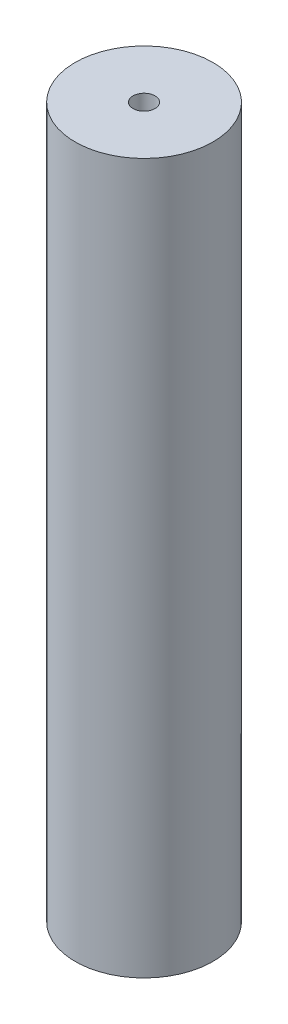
ISO-10303-21;
HEADER;
FILE_DESCRIPTION(('STEP AP214'),'2;1');
FILE_NAME('part.step','',(''),(''),'','','');
FILE_SCHEMA(('AUTOMOTIVE_DESIGN { 1 0 10303 214 1 1 1 1 }'));
ENDSEC;
DATA;
#1=APPLICATION_CONTEXT('core data for automotive mechanical design processes');
#2=APPLICATION_PROTOCOL_DEFINITION('international standard','automotive_design',2000,#1);
#3=PRODUCT_CONTEXT('',#1,'mechanical');
#4=PRODUCT('Part','Part','',(#3));
#5=PRODUCT_RELATED_PRODUCT_CATEGORY('part','',(#4));
#6=PRODUCT_DEFINITION_FORMATION('','',#4);
#7=PRODUCT_DEFINITION_CONTEXT('part definition',#1,'design');
#8=PRODUCT_DEFINITION('design','',#6,#7);
#9=PRODUCT_DEFINITION_SHAPE('','',#8);
#10=(LENGTH_UNIT() NAMED_UNIT(*) SI_UNIT(.MILLI.,.METRE.));
#11=(NAMED_UNIT(*) PLANE_ANGLE_UNIT() SI_UNIT($,.RADIAN.));
#12=(NAMED_UNIT(*) SI_UNIT($,.STERADIAN.) SOLID_ANGLE_UNIT());
#13=UNCERTAINTY_MEASURE_WITH_UNIT(LENGTH_MEASURE(1.E-05),#10,'distance_accuracy_value','');
#14=(GEOMETRIC_REPRESENTATION_CONTEXT(3) GLOBAL_UNCERTAINTY_ASSIGNED_CONTEXT((#13)) GLOBAL_UNIT_ASSIGNED_CONTEXT((#10,
#11,#12)) REPRESENTATION_CONTEXT('',''));
#15=CARTESIAN_POINT('',(0.,0.,0.));
#16=DIRECTION('',(0.,0.,1.));
#17=DIRECTION('',(1.,0.,0.));
#18=AXIS2_PLACEMENT_3D('',#15,#16,#17);
#19=CARTESIAN_POINT('',(15.,-19.2842712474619,130.));
#20=DIRECTION('',(0.,1.,0.));
#21=DIRECTION('',(0.,0.,1.));
#22=AXIS2_PLACEMENT_3D('',#19,#20,#21);
#23=CYLINDRICAL_SURFACE('',#22,10.);
#24=CARTESIAN_POINT('',(15.,110.,130.));
#25=DIRECTION('',(0.,-1.,0.));
#26=DIRECTION('',(0.,0.,-1.));
#27=AXIS2_PLACEMENT_3D('',#24,#25,#26);
#28=CIRCLE('',#27,10.);
#29=CARTESIAN_POINT('',(15.,110.,120.));
#30=VERTEX_POINT('',#29);
#31=EDGE_CURVE('E45',#30,#30,#28,.T.);
#32=ORIENTED_EDGE('',*,*,#31,.T.);
#33=EDGE_LOOP('',(#32));
#34=FACE_BOUND('',#33,.T.);
#35=CARTESIAN_POINT('',(15.,7.,130.));
#36=DIRECTION('',(0.,-1.,0.));
#37=DIRECTION('',(0.,0.,-1.));
#38=AXIS2_PLACEMENT_3D('',#35,#36,#37);
#39=CIRCLE('',#38,10.);
#40=CARTESIAN_POINT('',(15.,7.,120.));
#41=VERTEX_POINT('',#40);
#42=EDGE_CURVE('E12',#41,#41,#39,.T.);
#43=ORIENTED_EDGE('',*,*,#42,.F.);
#44=EDGE_LOOP('',(#43));
#45=FACE_BOUND('',#44,.T.);
#46=ADVANCED_FACE('F37',(#34,#45),#23,.T.);
#47=CARTESIAN_POINT('',(15.,110.,130.));
#48=DIRECTION('',(0.,-1.,0.));
#49=DIRECTION('',(0.,0.,-1.));
#50=AXIS2_PLACEMENT_3D('',#47,#48,#49);
#51=PLANE('',#50);
#52=CARTESIAN_POINT('',(15.,110.,130.));
#53=DIRECTION('',(0.,-1.,0.));
#54=DIRECTION('',(0.,0.,-1.));
#55=AXIS2_PLACEMENT_3D('',#52,#53,#54);
#56=CIRCLE('',#55,1.6);
#57=CARTESIAN_POINT('',(15.,110.,128.4));
#58=VERTEX_POINT('',#57);
#59=EDGE_CURVE('E57',#58,#58,#56,.T.);
#60=ORIENTED_EDGE('',*,*,#59,.T.);
#61=EDGE_LOOP('',(#60));
#62=FACE_BOUND('',#61,.T.);
#63=ORIENTED_EDGE('',*,*,#31,.F.);
#64=EDGE_LOOP('',(#63));
#65=FACE_BOUND('',#64,.T.);
#66=ADVANCED_FACE('F72',(#62,#65),#51,.F.);
#67=CARTESIAN_POINT('',(175.,7.,0.));
#68=DIRECTION('',(0.,-1.,0.));
#69=DIRECTION('',(0.,0.,-1.));
#70=AXIS2_PLACEMENT_3D('',#67,#68,#69);
#71=PLANE('',#70);
#72=CARTESIAN_POINT('',(15.,7.,130.));
#73=DIRECTION('',(0.,-1.,0.));
#74=DIRECTION('',(0.,0.,-1.));
#75=AXIS2_PLACEMENT_3D('',#72,#73,#74);
#76=CIRCLE('',#75,1.6);
#77=CARTESIAN_POINT('',(15.,7.,128.4));
#78=VERTEX_POINT('',#77);
#79=EDGE_CURVE('E56',#78,#78,#76,.T.);
#80=ORIENTED_EDGE('',*,*,#79,.F.);
#81=EDGE_LOOP('',(#80));
#82=FACE_BOUND('',#81,.T.);
#83=ORIENTED_EDGE('',*,*,#42,.T.);
#84=EDGE_LOOP('',(#83));
#85=FACE_BOUND('',#84,.T.);
#86=ADVANCED_FACE('F52',(#82,#85),#71,.T.);
#87=CARTESIAN_POINT('',(15.,20.8571673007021,130.));
#88=DIRECTION('',(0.,-1.,0.));
#89=DIRECTION('',(0.,0.,-1.));
#90=AXIS2_PLACEMENT_3D('',#87,#88,#89);
#91=CONICAL_SURFACE('',#90,2.11503807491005,1.02974425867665);
#92=CARTESIAN_POINT('',(15.,22.1280103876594,130.));
#93=VERTEX_POINT('',#92);
#94=VERTEX_LOOP('',#93);
#95=FACE_BOUND('',#94,.T.);
#96=CARTESIAN_POINT('',(15.,21.1666333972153,130.));
#97=DIRECTION('',(0.,-1.,0.));
#98=DIRECTION('',(0.,0.,-1.));
#99=AXIS2_PLACEMENT_3D('',#96,#97,#98);
#100=CIRCLE('',#99,1.6);
#101=CARTESIAN_POINT('',(15.,21.1666333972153,128.4));
#102=VERTEX_POINT('',#101);
#103=EDGE_CURVE('E41',#102,#102,#100,.T.);
#104=ORIENTED_EDGE('',*,*,#103,.T.);
#105=EDGE_LOOP('',(#104));
#106=FACE_BOUND('',#105,.T.);
#107=ADVANCED_FACE('F39',(#95,#106),#91,.F.);
#108=CARTESIAN_POINT('',(15.,0.,130.));
#109=DIRECTION('',(0.,-1.,0.));
#110=DIRECTION('',(0.,0.,-1.));
#111=AXIS2_PLACEMENT_3D('',#108,#109,#110);
#112=CYLINDRICAL_SURFACE('',#111,1.6);
#113=ORIENTED_EDGE('',*,*,#79,.T.);
#114=EDGE_LOOP('',(#113));
#115=FACE_BOUND('',#114,.T.);
#116=ORIENTED_EDGE('',*,*,#103,.F.);
#117=EDGE_LOOP('',(#116));
#118=FACE_BOUND('',#117,.T.);
#119=ADVANCED_FACE('F51',(#115,#118),#112,.F.);
#120=CARTESIAN_POINT('',(15.,99.5,130.));
#121=DIRECTION('',(0.,1.,0.));
#122=DIRECTION('',(0.,0.,1.));
#123=AXIS2_PLACEMENT_3D('',#120,#121,#122);
#124=CYLINDRICAL_SURFACE('',#123,1.6);
#125=CARTESIAN_POINT('',(15.,99.5,130.));
#126=DIRECTION('',(0.,1.,0.));
#127=DIRECTION('',(0.,0.,1.));
#128=AXIS2_PLACEMENT_3D('',#125,#126,#127);
#129=CIRCLE('',#128,1.6);
#130=CARTESIAN_POINT('',(15.,99.5,131.6));
#131=VERTEX_POINT('',#130);
#132=EDGE_CURVE('E61',#131,#131,#129,.T.);
#133=ORIENTED_EDGE('',*,*,#132,.F.);
#134=EDGE_LOOP('',(#133));
#135=FACE_BOUND('',#134,.T.);
#136=ORIENTED_EDGE('',*,*,#59,.F.);
#137=EDGE_LOOP('',(#136));
#138=FACE_BOUND('',#137,.T.);
#139=ADVANCED_FACE('F84',(#135,#138),#124,.F.);
#140=CARTESIAN_POINT('',(15.,99.5,130.));
#141=DIRECTION('',(0.,1.,0.));
#142=DIRECTION('',(0.,0.,1.));
#143=AXIS2_PLACEMENT_3D('',#140,#141,#142);
#144=PLANE('',#143);
#145=ORIENTED_EDGE('',*,*,#132,.T.);
#146=EDGE_LOOP('',(#145));
#147=FACE_BOUND('',#146,.T.);
#148=ADVANCED_FACE('F88',(#147),#144,.T.);
#149=CLOSED_SHELL('',(#46,#66,#86,#107,#119,#139,#148));
#150=MANIFOLD_SOLID_BREP('B2',#149);
#151=ADVANCED_BREP_SHAPE_REPRESENTATION('',(#18,#150),#14);
#152=SHAPE_DEFINITION_REPRESENTATION(#9,#151);
ENDSEC;
END-ISO-10303-21;
